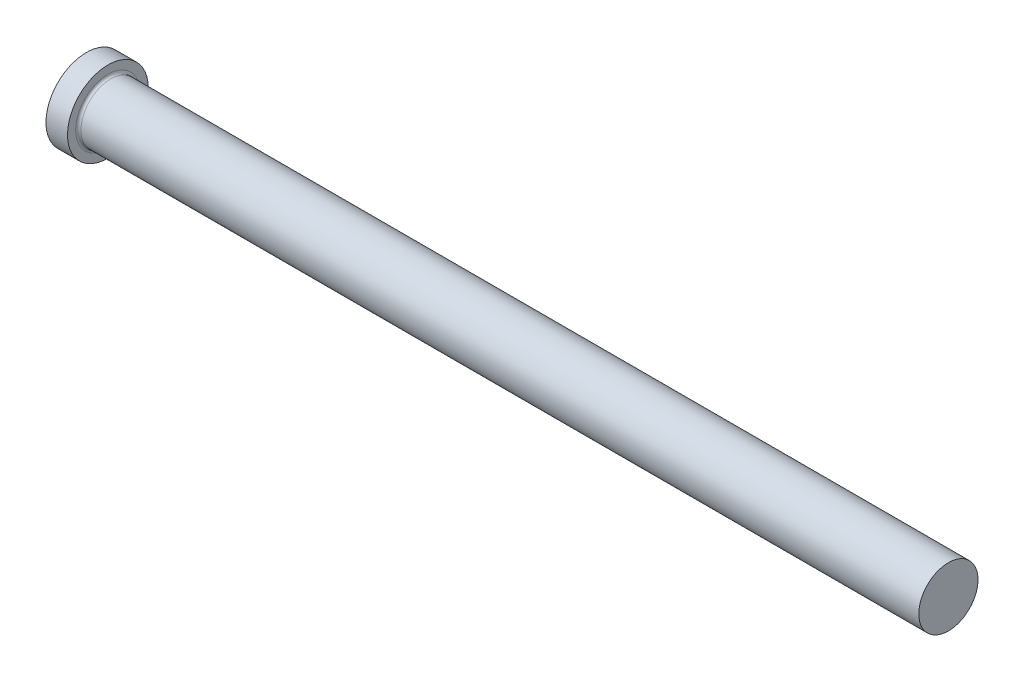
ISO-10303-21;
HEADER;
FILE_DESCRIPTION(('STEP AP214'),'2;1');
FILE_NAME('part.step','',(''),(''),'','','');
FILE_SCHEMA(('AUTOMOTIVE_DESIGN { 1 0 10303 214 1 1 1 1 }'));
ENDSEC;
DATA;
#1=APPLICATION_CONTEXT('core data for automotive mechanical design processes');
#2=APPLICATION_PROTOCOL_DEFINITION('international standard','automotive_design',2000,#1);
#3=PRODUCT_CONTEXT('',#1,'mechanical');
#4=PRODUCT('Part','Part','',(#3));
#5=PRODUCT_RELATED_PRODUCT_CATEGORY('part','',(#4));
#6=PRODUCT_DEFINITION_FORMATION('','',#4);
#7=PRODUCT_DEFINITION_CONTEXT('part definition',#1,'design');
#8=PRODUCT_DEFINITION('design','',#6,#7);
#9=PRODUCT_DEFINITION_SHAPE('','',#8);
#10=(LENGTH_UNIT() NAMED_UNIT(*) SI_UNIT(.MILLI.,.METRE.));
#11=(NAMED_UNIT(*) PLANE_ANGLE_UNIT() SI_UNIT($,.RADIAN.));
#12=(NAMED_UNIT(*) SI_UNIT($,.STERADIAN.) SOLID_ANGLE_UNIT());
#13=UNCERTAINTY_MEASURE_WITH_UNIT(LENGTH_MEASURE(1.E-05),#10,'distance_accuracy_value','');
#14=(GEOMETRIC_REPRESENTATION_CONTEXT(3) GLOBAL_UNCERTAINTY_ASSIGNED_CONTEXT((#13)) GLOBAL_UNIT_ASSIGNED_CONTEXT((#10,
#11,#12)) REPRESENTATION_CONTEXT('',''));
#15=CARTESIAN_POINT('',(0.,0.,0.));
#16=DIRECTION('',(0.,0.,1.));
#17=DIRECTION('',(1.,0.,0.));
#18=AXIS2_PLACEMENT_3D('',#15,#16,#17);
#19=CARTESIAN_POINT('',(0.,0.,0.));
#20=DIRECTION('',(1.,0.,0.));
#21=DIRECTION('',(0.,1.,0.));
#22=AXIS2_PLACEMENT_3D('',#19,#20,#21);
#23=PLANE('',#22);
#24=CARTESIAN_POINT('',(0.,0.,0.));
#25=DIRECTION('',(-1.,0.,0.));
#26=DIRECTION('',(0.,-1.,0.));
#27=AXIS2_PLACEMENT_3D('',#24,#25,#26);
#28=CIRCLE('',#27,11.90625);
#29=CARTESIAN_POINT('',(0.,-11.90625,0.));
#30=VERTEX_POINT('',#29);
#31=EDGE_CURVE('E10',#30,#30,#28,.T.);
#32=ORIENTED_EDGE('',*,*,#31,.T.);
#33=EDGE_LOOP('',(#32));
#34=FACE_BOUND('',#33,.T.);
#35=ADVANCED_FACE('F29',(#34),#23,.F.);
#36=CARTESIAN_POINT('',(254.,0.,0.));
#37=DIRECTION('',(-1.,0.,0.));
#38=DIRECTION('',(0.,-1.,0.));
#39=AXIS2_PLACEMENT_3D('',#36,#37,#38);
#40=CYLINDRICAL_SURFACE('',#39,11.90625);
#41=ORIENTED_EDGE('',*,*,#31,.F.);
#42=EDGE_LOOP('',(#41));
#43=FACE_BOUND('',#42,.T.);
#44=CARTESIAN_POINT('',(6.34999999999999,0.,0.));
#45=DIRECTION('',(-1.,0.,0.));
#46=DIRECTION('',(0.,-1.,0.));
#47=AXIS2_PLACEMENT_3D('',#44,#45,#46);
#48=CIRCLE('',#47,11.90625);
#49=CARTESIAN_POINT('',(6.34999999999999,-11.90625,0.));
#50=VERTEX_POINT('',#49);
#51=EDGE_CURVE('E35',#50,#50,#48,.T.);
#52=ORIENTED_EDGE('',*,*,#51,.T.);
#53=EDGE_LOOP('',(#52));
#54=FACE_BOUND('',#53,.T.);
#55=ADVANCED_FACE('F64',(#43,#54),#40,.T.);
#56=CARTESIAN_POINT('',(6.35,11.90625,0.));
#57=DIRECTION('',(-1.,0.,0.));
#58=DIRECTION('',(0.,-1.,0.));
#59=AXIS2_PLACEMENT_3D('',#56,#57,#58);
#60=PLANE('',#59);
#61=ORIENTED_EDGE('',*,*,#51,.F.);
#62=EDGE_LOOP('',(#61));
#63=FACE_BOUND('',#62,.T.);
#64=CARTESIAN_POINT('',(6.34999999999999,0.,0.));
#65=DIRECTION('',(-1.,0.,0.));
#66=DIRECTION('',(0.,-1.,0.));
#67=AXIS2_PLACEMENT_3D('',#64,#65,#66);
#68=CIRCLE('',#67,9.5123);
#69=CARTESIAN_POINT('',(6.34999999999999,-9.5123,0.));
#70=VERTEX_POINT('',#69);
#71=EDGE_CURVE('E39',#70,#70,#68,.T.);
#72=ORIENTED_EDGE('',*,*,#71,.T.);
#73=EDGE_LOOP('',(#72));
#74=FACE_BOUND('',#73,.T.);
#75=ADVANCED_FACE('F68',(#63,#74),#60,.F.);
#76=CARTESIAN_POINT('',(7.1374,0.,0.));
#77=DIRECTION('',(-1.,0.,0.));
#78=DIRECTION('',(0.,-1.,0.));
#79=AXIS2_PLACEMENT_3D('',#76,#77,#78);
#80=TOROIDAL_SURFACE('',#79,9.5123,0.7874);
#81=ORIENTED_EDGE('',*,*,#71,.F.);
#82=EDGE_LOOP('',(#81));
#83=FACE_BOUND('',#82,.T.);
#84=CARTESIAN_POINT('',(7.13739999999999,0.,0.));
#85=DIRECTION('',(-1.,0.,0.));
#86=DIRECTION('',(0.,-1.,0.));
#87=AXIS2_PLACEMENT_3D('',#84,#85,#86);
#88=CIRCLE('',#87,8.7249);
#89=CARTESIAN_POINT('',(7.13739999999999,-8.7249,0.));
#90=VERTEX_POINT('',#89);
#91=EDGE_CURVE('E43',#90,#90,#88,.T.);
#92=ORIENTED_EDGE('',*,*,#91,.T.);
#93=EDGE_LOOP('',(#92));
#94=FACE_BOUND('',#93,.T.);
#95=ADVANCED_FACE('F60',(#83,#94),#80,.F.);
#96=CARTESIAN_POINT('',(254.,0.,0.));
#97=DIRECTION('',(-1.,0.,0.));
#98=DIRECTION('',(0.,-1.,0.));
#99=AXIS2_PLACEMENT_3D('',#96,#97,#98);
#100=CYLINDRICAL_SURFACE('',#99,8.7249);
#101=ORIENTED_EDGE('',*,*,#91,.F.);
#102=EDGE_LOOP('',(#101));
#103=FACE_BOUND('',#102,.T.);
#104=CARTESIAN_POINT('',(254.,0.,0.));
#105=DIRECTION('',(-1.,0.,0.));
#106=DIRECTION('',(0.,-1.,0.));
#107=AXIS2_PLACEMENT_3D('',#104,#105,#106);
#108=CIRCLE('',#107,8.72489999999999);
#109=CARTESIAN_POINT('',(254.,-8.72489999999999,0.));
#110=VERTEX_POINT('',#109);
#111=EDGE_CURVE('E48',#110,#110,#108,.T.);
#112=ORIENTED_EDGE('',*,*,#111,.T.);
#113=EDGE_LOOP('',(#112));
#114=FACE_BOUND('',#113,.T.);
#115=ADVANCED_FACE('F52',(#103,#114),#100,.T.);
#116=CARTESIAN_POINT('',(254.,8.7249,0.));
#117=DIRECTION('',(-1.,0.,0.));
#118=DIRECTION('',(0.,-1.,0.));
#119=AXIS2_PLACEMENT_3D('',#116,#117,#118);
#120=PLANE('',#119);
#121=ORIENTED_EDGE('',*,*,#111,.F.);
#122=EDGE_LOOP('',(#121));
#123=FACE_BOUND('',#122,.T.);
#124=ADVANCED_FACE('F54',(#123),#120,.F.);
#125=CLOSED_SHELL('',(#35,#55,#75,#95,#115,#124));
#126=MANIFOLD_SOLID_BREP('B2',#125);
#127=ADVANCED_BREP_SHAPE_REPRESENTATION('',(#18,#126),#14);
#128=SHAPE_DEFINITION_REPRESENTATION(#9,#127);
ENDSEC;
END-ISO-10303-21;
